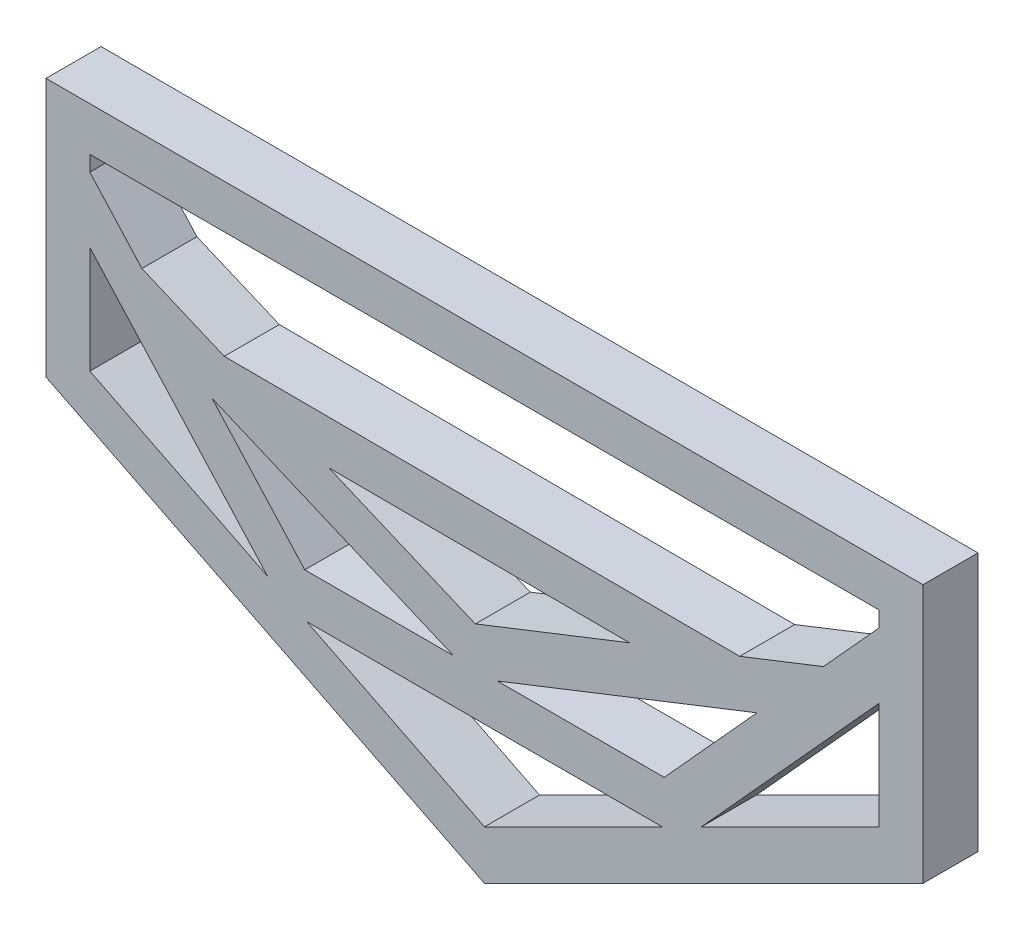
from build123d import *

# Parameters (mm, degrees)
BOSS_EXTRUDE1_DEPTH = 19


with BuildPart() as part:
    # Sketch1 → Boss-Extrude1 (new body)
    with BuildSketch(Plane.XY):
        Polygon((-115, 120.142857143), (-115, 30.799999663), (36.428572, -44.914286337), (187.857144, 30.799999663), (187.857144, 120.142857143), align=None)
        Polygon((172.7142868, 104.999999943), (172.7142868, 99.659487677), (153.48463744, 78.462693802), (124.551423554, 67.070135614), (-53.439583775, 67.801982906), (-81.878563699, 79.841745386), (-99.8571428, 99.659487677), (-99.8571428, 104.999999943), align=None, mode=Mode.SUBTRACT)
        Polygon((36.428572, -27.984057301), (97.799337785, 2.701325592), (-24.942193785, 2.701325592), align=None, mode=Mode.SUBTRACT)
        Polygon((-99.8571428, 40.158800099), (-38.486377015, 9.473417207), (-99.8571428, 77.122257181), align=None, mode=Mode.SUBTRACT)
        Polygon((-17.319714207, 52.510483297), (86.490845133, 52.083644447), (33.294447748, 31.13736952), (33.294447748, 31.082763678), align=None, mode=Mode.SUBTRACT)
        Polygon((111.343521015, 9.473417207), (172.7142868, 77.122257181), (172.7142868, 40.158800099), align=None, mode=Mode.SUBTRACT)
        Polygon((-25.63461488, 17.844182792), (25.723019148, 17.844182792), (-57.658605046, 53.144146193), align=None, mode=Mode.SUBTRACT)
        Polygon((98.49175888, 17.844182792), (130.515749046, 53.144146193), (40.865876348, 17.844182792), align=None, mode=Mode.SUBTRACT)
    extrude(amount=BOSS_EXTRUDE1_DEPTH)


solid = part.part
